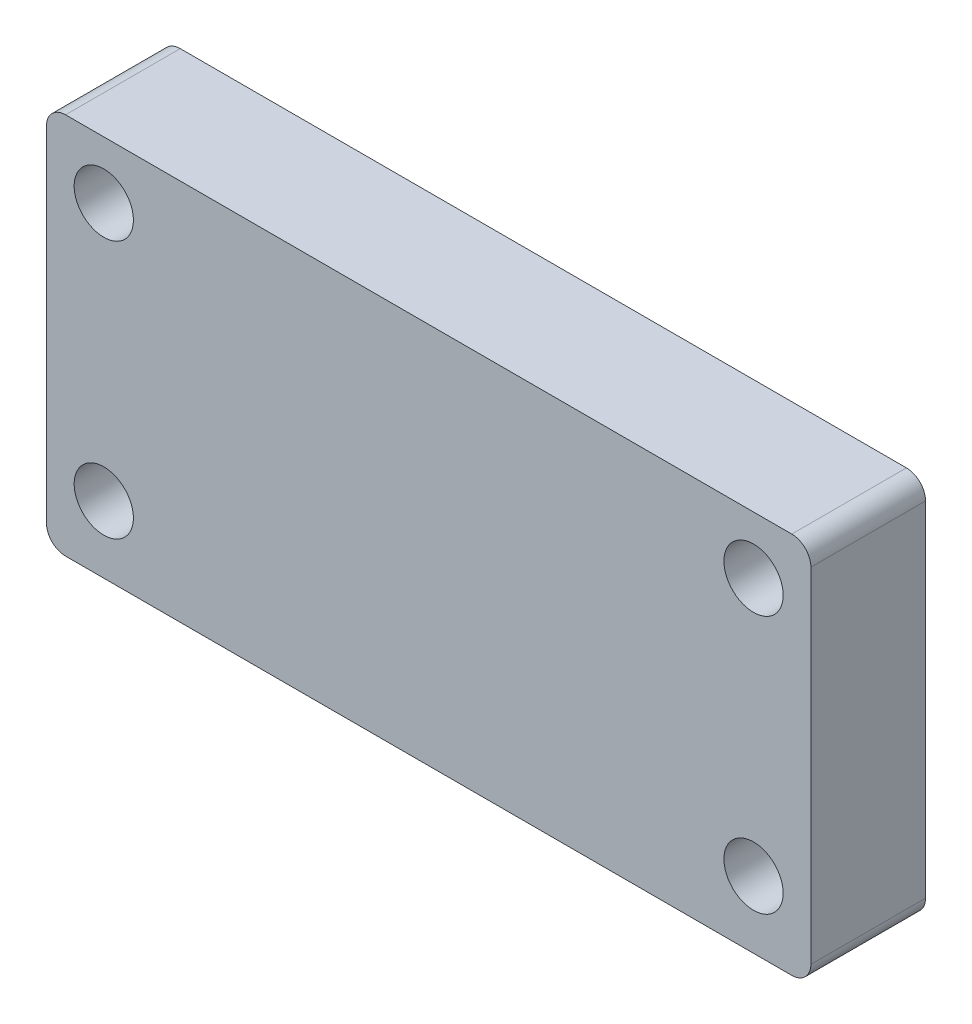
from build123d import *

# Parameters (mm, degrees)
ESQUISSE1_W             = 40
ESQUISSE1_H             = 20
ESQUISSE1_R             = 1.55
BOSS_EXTRU_1_DEPTH      = 6
ENL_V_START             = -5.5
ESQUISSE2_R             = 7.5
ENL_V_MAT_EXTRU_1_DEPTH = 25
CONG_1_R                = 1


with BuildPart() as part:
    # Esquisse1 → Boss.-Extru.1 (new body)
    with BuildSketch(Plane.XY):
        with Locations((20, 10)):
            Rectangle(ESQUISSE1_W, ESQUISSE1_H)
        with Locations((3, 17)):
            Circle(ESQUISSE1_R, mode=Mode.SUBTRACT)
        with Locations((37, 17)):
            Circle(ESQUISSE1_R, mode=Mode.SUBTRACT)
        with Locations((37, 3.5)):
            Circle(ESQUISSE1_R, mode=Mode.SUBTRACT)
        with Locations((3, 3.5)):
            Circle(ESQUISSE1_R, mode=Mode.SUBTRACT)
    extrude(amount=BOSS_EXTRU_1_DEPTH)

    # Esquisse2 → Enl_v. mat.-Extru.1 (cut)
    with BuildSketch(Plane.ZY.offset(ENL_V_START)):
        with Locations((-5, 12)):
            Circle(ESQUISSE2_R)
    extrude(amount=-ENL_V_MAT_EXTRU_1_DEPTH, mode=Mode.SUBTRACT)

    # Cong_1
    cong_1_edges = [part.edges().sort_by_distance(p)[0] for p in [
        (0, 20, 3),
        (40, 20, 3),
        (40, 0, 3),
        (0, 0, 3),
    ]]
    fillet(cong_1_edges, radius=CONG_1_R)


solid = part.part
